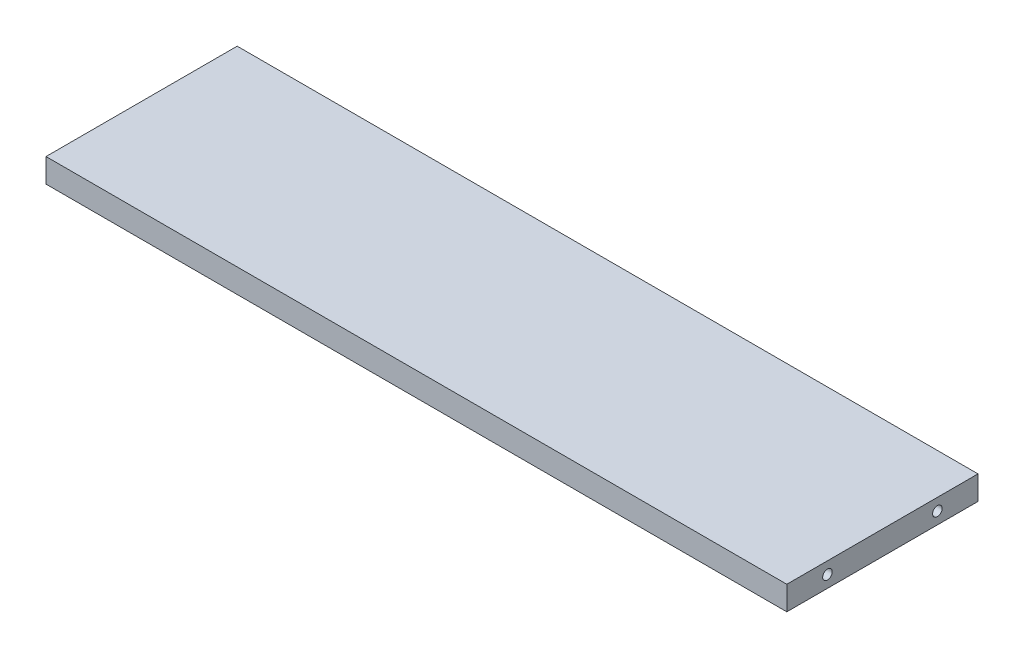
from build123d import *

# Parameters (mm, degrees)
ESQUISSE1_W             = 310
ESQUISSE1_H             = 10
EXTRUSION1_DEPTH        = 80
ESQUISSE2_R             = 2
ENL_V_MAT_EXTRU_1_DEPTH = 10
ENL_V_START             = -10
ESQUISSE7_R             = 2
ENL_V_MAT_EXTRU_2_DEPTH = 10


with BuildPart() as part:
    # Esquisse1 → Extrusion1 (new body)
    with BuildSketch(Plane.XY):
        with Locations((155, 5)):
            Rectangle(ESQUISSE1_W, ESQUISSE1_H)
    extrude(amount=-EXTRUSION1_DEPTH)

    # Esquisse2 → Enl_v. mat.-Extru.1 (cut)
    with BuildSketch(Plane(origin=(310, 0, 0), x_dir=(0, 0, -1), z_dir=(1, 0, 0))):
        with Locations((17, 5)):
            Circle(ESQUISSE2_R)
        with Locations(Location((63, 5, 0), (0, 0, 180))):
            Circle(ESQUISSE2_R)
    extrude(amount=-ENL_V_MAT_EXTRU_1_DEPTH, mode=Mode.SUBTRACT)

    # Esquisse7 → Enl_v. mat.-Extru.2 (cut)
    with BuildSketch(Plane.ZY.offset(ENL_V_START)):
        with Locations((-63, 5)):
            Circle(ESQUISSE7_R)
        with Locations(Location((-17, 5, 0), (0, 0, 180))):
            Circle(ESQUISSE7_R)
    extrude(amount=ENL_V_MAT_EXTRU_2_DEPTH, mode=Mode.SUBTRACT)


solid = part.part
